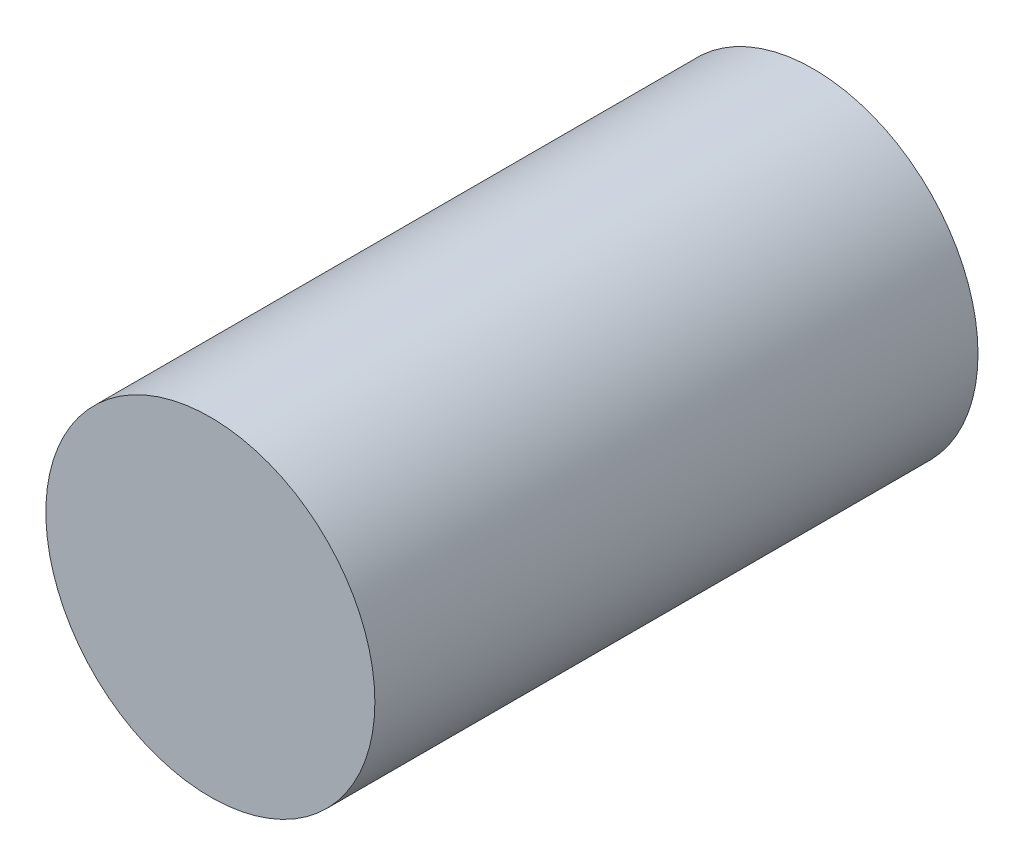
ISO-10303-21;
HEADER;
FILE_DESCRIPTION(('STEP AP214'),'2;1');
FILE_NAME('part.step','',(''),(''),'','','');
FILE_SCHEMA(('AUTOMOTIVE_DESIGN { 1 0 10303 214 1 1 1 1 }'));
ENDSEC;
DATA;
#1=APPLICATION_CONTEXT('core data for automotive mechanical design processes');
#2=APPLICATION_PROTOCOL_DEFINITION('international standard','automotive_design',2000,#1);
#3=PRODUCT_CONTEXT('',#1,'mechanical');
#4=PRODUCT('Part','Part','',(#3));
#5=PRODUCT_RELATED_PRODUCT_CATEGORY('part','',(#4));
#6=PRODUCT_DEFINITION_FORMATION('','',#4);
#7=PRODUCT_DEFINITION_CONTEXT('part definition',#1,'design');
#8=PRODUCT_DEFINITION('design','',#6,#7);
#9=PRODUCT_DEFINITION_SHAPE('','',#8);
#10=(LENGTH_UNIT() NAMED_UNIT(*) SI_UNIT(.MILLI.,.METRE.));
#11=(NAMED_UNIT(*) PLANE_ANGLE_UNIT() SI_UNIT($,.RADIAN.));
#12=(NAMED_UNIT(*) SI_UNIT($,.STERADIAN.) SOLID_ANGLE_UNIT());
#13=UNCERTAINTY_MEASURE_WITH_UNIT(LENGTH_MEASURE(1.E-05),#10,'distance_accuracy_value','');
#14=(GEOMETRIC_REPRESENTATION_CONTEXT(3) GLOBAL_UNCERTAINTY_ASSIGNED_CONTEXT((#13)) GLOBAL_UNIT_ASSIGNED_CONTEXT((#10,
#11,#12)) REPRESENTATION_CONTEXT('',''));
#15=CARTESIAN_POINT('',(0.,0.,0.));
#16=DIRECTION('',(0.,0.,1.));
#17=DIRECTION('',(1.,0.,0.));
#18=AXIS2_PLACEMENT_3D('',#15,#16,#17);
#19=CARTESIAN_POINT('',(0.,0.,133.35));
#20=DIRECTION('',(0.,0.,-1.));
#21=DIRECTION('',(-1.,0.,0.));
#22=AXIS2_PLACEMENT_3D('',#19,#20,#21);
#23=CYLINDRICAL_SURFACE('',#22,36.3728);
#24=CARTESIAN_POINT('',(0.,0.,133.35));
#25=DIRECTION('',(0.,0.,1.));
#26=DIRECTION('',(1.,0.,0.));
#27=AXIS2_PLACEMENT_3D('',#24,#25,#26);
#28=CIRCLE('',#27,36.3728);
#29=CARTESIAN_POINT('',(36.3728,0.,133.35));
#30=VERTEX_POINT('',#29);
#31=EDGE_CURVE('E10',#30,#30,#28,.T.);
#32=ORIENTED_EDGE('',*,*,#31,.F.);
#33=EDGE_LOOP('',(#32));
#34=FACE_BOUND('',#33,.T.);
#35=CARTESIAN_POINT('',(0.,0.,0.));
#36=DIRECTION('',(0.,0.,1.));
#37=DIRECTION('',(1.,0.,0.));
#38=AXIS2_PLACEMENT_3D('',#35,#36,#37);
#39=CIRCLE('',#38,36.3728);
#40=CARTESIAN_POINT('',(36.3728,0.,0.));
#41=VERTEX_POINT('',#40);
#42=EDGE_CURVE('E34',#41,#41,#39,.T.);
#43=ORIENTED_EDGE('',*,*,#42,.T.);
#44=EDGE_LOOP('',(#43));
#45=FACE_BOUND('',#44,.T.);
#46=ADVANCED_FACE('F31',(#34,#45),#23,.T.);
#47=CARTESIAN_POINT('',(0.,0.,133.35));
#48=DIRECTION('',(0.,0.,1.));
#49=DIRECTION('',(1.,0.,0.));
#50=AXIS2_PLACEMENT_3D('',#47,#48,#49);
#51=PLANE('',#50);
#52=ORIENTED_EDGE('',*,*,#31,.T.);
#53=EDGE_LOOP('',(#52));
#54=FACE_BOUND('',#53,.T.);
#55=ADVANCED_FACE('F46',(#54),#51,.T.);
#56=CARTESIAN_POINT('',(0.,0.,0.));
#57=DIRECTION('',(0.,0.,1.));
#58=DIRECTION('',(1.,0.,0.));
#59=AXIS2_PLACEMENT_3D('',#56,#57,#58);
#60=PLANE('',#59);
#61=ORIENTED_EDGE('',*,*,#42,.F.);
#62=EDGE_LOOP('',(#61));
#63=FACE_BOUND('',#62,.T.);
#64=ADVANCED_FACE('F44',(#63),#60,.F.);
#65=CLOSED_SHELL('',(#46,#55,#64));
#66=MANIFOLD_SOLID_BREP('B2',#65);
#67=ADVANCED_BREP_SHAPE_REPRESENTATION('',(#18,#66),#14);
#68=SHAPE_DEFINITION_REPRESENTATION(#9,#67);
ENDSEC;
END-ISO-10303-21;
